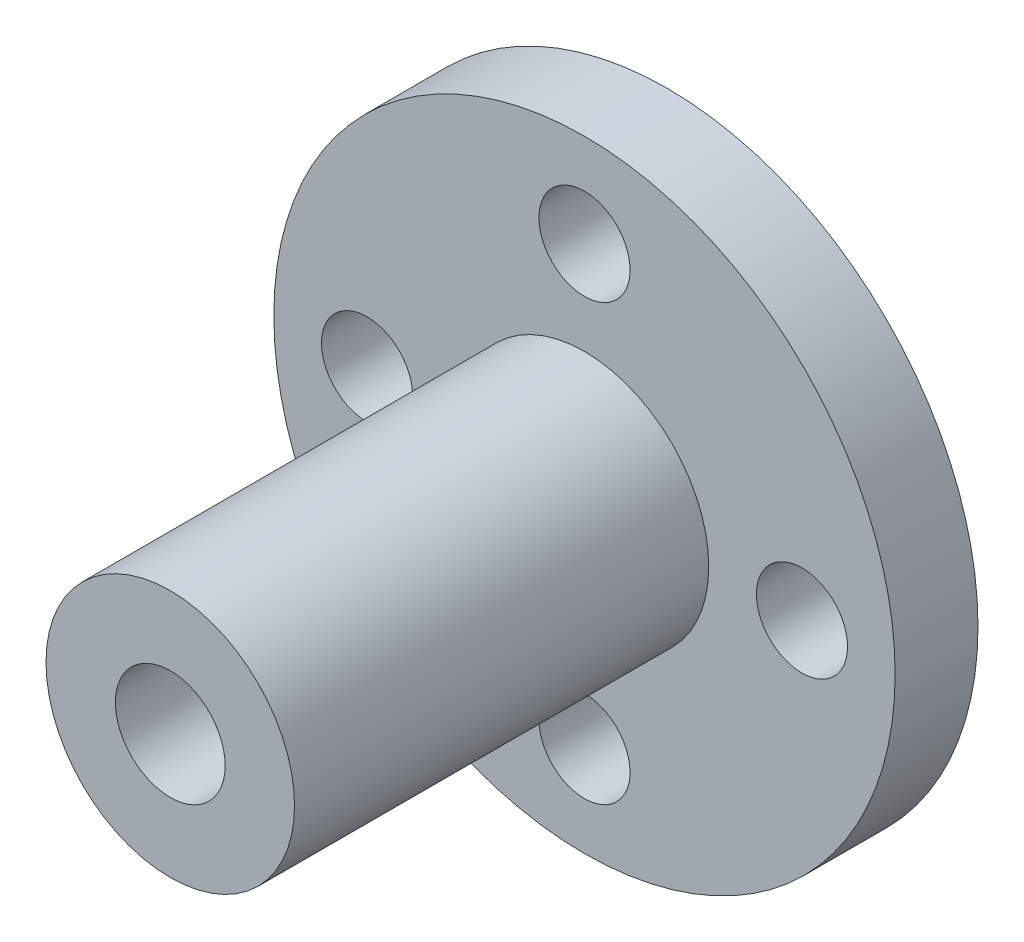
ISO-10303-21;
HEADER;
FILE_DESCRIPTION(('STEP AP214'),'2;1');
FILE_NAME('part.step','',(''),(''),'','','');
FILE_SCHEMA(('AUTOMOTIVE_DESIGN { 1 0 10303 214 1 1 1 1 }'));
ENDSEC;
DATA;
#1=APPLICATION_CONTEXT('core data for automotive mechanical design processes');
#2=APPLICATION_PROTOCOL_DEFINITION('international standard','automotive_design',2000,#1);
#3=PRODUCT_CONTEXT('',#1,'mechanical');
#4=PRODUCT('Part','Part','',(#3));
#5=PRODUCT_RELATED_PRODUCT_CATEGORY('part','',(#4));
#6=PRODUCT_DEFINITION_FORMATION('','',#4);
#7=PRODUCT_DEFINITION_CONTEXT('part definition',#1,'design');
#8=PRODUCT_DEFINITION('design','',#6,#7);
#9=PRODUCT_DEFINITION_SHAPE('','',#8);
#10=(LENGTH_UNIT() NAMED_UNIT(*) SI_UNIT(.MILLI.,.METRE.));
#11=(NAMED_UNIT(*) PLANE_ANGLE_UNIT() SI_UNIT($,.RADIAN.));
#12=(NAMED_UNIT(*) SI_UNIT($,.STERADIAN.) SOLID_ANGLE_UNIT());
#13=UNCERTAINTY_MEASURE_WITH_UNIT(LENGTH_MEASURE(1.E-05),#10,'distance_accuracy_value','');
#14=(GEOMETRIC_REPRESENTATION_CONTEXT(3) GLOBAL_UNCERTAINTY_ASSIGNED_CONTEXT((#13)) GLOBAL_UNIT_ASSIGNED_CONTEXT((#10,
#11,#12)) REPRESENTATION_CONTEXT('',''));
#15=CARTESIAN_POINT('',(0.,0.,0.));
#16=DIRECTION('',(0.,0.,1.));
#17=DIRECTION('',(1.,0.,0.));
#18=AXIS2_PLACEMENT_3D('',#15,#16,#17);
#19=CARTESIAN_POINT('',(0.,0.,0.));
#20=DIRECTION('',(0.,0.,1.));
#21=DIRECTION('',(1.,0.,0.));
#22=AXIS2_PLACEMENT_3D('',#19,#20,#21);
#23=PLANE('',#22);
#24=CARTESIAN_POINT('',(0.,0.,0.));
#25=DIRECTION('',(0.,0.,1.));
#26=DIRECTION('',(1.,0.,0.));
#27=AXIS2_PLACEMENT_3D('',#24,#25,#26);
#28=CIRCLE('',#27,75.);
#29=CARTESIAN_POINT('',(75.,0.,0.));
#30=VERTEX_POINT('',#29);
#31=EDGE_CURVE('E41',#30,#30,#28,.T.);
#32=ORIENTED_EDGE('',*,*,#31,.F.);
#33=EDGE_LOOP('',(#32));
#34=FACE_BOUND('',#33,.T.);
#35=CARTESIAN_POINT('',(52.5,0.,0.));
#36=DIRECTION('',(0.,0.,1.));
#37=DIRECTION('',(1.,0.,0.));
#38=AXIS2_PLACEMENT_3D('',#35,#36,#37);
#39=CIRCLE('',#38,11.);
#40=CARTESIAN_POINT('',(63.5,0.,0.));
#41=VERTEX_POINT('',#40);
#42=EDGE_CURVE('E46',#41,#41,#39,.T.);
#43=ORIENTED_EDGE('',*,*,#42,.T.);
#44=EDGE_LOOP('',(#43));
#45=FACE_BOUND('',#44,.T.);
#46=CARTESIAN_POINT('',(-1.83302770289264E-13,52.5,0.));
#47=DIRECTION('',(0.,0.,1.));
#48=DIRECTION('',(0.,1.,0.));
#49=AXIS2_PLACEMENT_3D('',#46,#47,#48);
#50=CIRCLE('',#49,11.);
#51=CARTESIAN_POINT('',(-2.21709065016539E-13,63.5,0.));
#52=VERTEX_POINT('',#51);
#53=EDGE_CURVE('E51',#52,#52,#50,.T.);
#54=ORIENTED_EDGE('',*,*,#53,.T.);
#55=EDGE_LOOP('',(#54));
#56=FACE_BOUND('',#55,.T.);
#57=CARTESIAN_POINT('',(-52.5,-3.66605540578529E-13,0.));
#58=DIRECTION('',(0.,0.,1.));
#59=DIRECTION('',(-1.,0.,0.));
#60=AXIS2_PLACEMENT_3D('',#57,#58,#59);
#61=CIRCLE('',#60,11.);
#62=CARTESIAN_POINT('',(-63.5,-4.43418130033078E-13,0.));
#63=VERTEX_POINT('',#62);
#64=EDGE_CURVE('E57',#63,#63,#61,.T.);
#65=ORIENTED_EDGE('',*,*,#64,.T.);
#66=EDGE_LOOP('',(#65));
#67=FACE_BOUND('',#66,.T.);
#68=CARTESIAN_POINT('',(5.49908310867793E-13,-52.5,0.));
#69=DIRECTION('',(0.,0.,1.));
#70=DIRECTION('',(0.,-1.,0.));
#71=AXIS2_PLACEMENT_3D('',#68,#69,#70);
#72=CIRCLE('',#71,11.);
#73=CARTESIAN_POINT('',(6.65127195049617E-13,-63.5,0.));
#74=VERTEX_POINT('',#73);
#75=EDGE_CURVE('E63',#74,#74,#72,.T.);
#76=ORIENTED_EDGE('',*,*,#75,.T.);
#77=EDGE_LOOP('',(#76));
#78=FACE_BOUND('',#77,.T.);
#79=CARTESIAN_POINT('',(0.,0.,0.));
#80=DIRECTION('',(0.,0.,1.));
#81=DIRECTION('',(1.,0.,0.));
#82=AXIS2_PLACEMENT_3D('',#79,#80,#81);
#83=CIRCLE('',#82,13.25);
#84=CARTESIAN_POINT('',(13.25,0.,0.));
#85=VERTEX_POINT('',#84);
#86=EDGE_CURVE('E75',#85,#85,#83,.T.);
#87=ORIENTED_EDGE('',*,*,#86,.T.);
#88=EDGE_LOOP('',(#87));
#89=FACE_BOUND('',#88,.T.);
#90=ADVANCED_FACE('F30',(#34,#45,#56,#67,#78,#89),#23,.F.);
#91=CARTESIAN_POINT('',(0.,0.,120.));
#92=DIRECTION('',(0.,0.,-1.));
#93=DIRECTION('',(-1.,0.,0.));
#94=AXIS2_PLACEMENT_3D('',#91,#92,#93);
#95=PLANE('',#94);
#96=CARTESIAN_POINT('',(0.,0.,120.));
#97=DIRECTION('',(0.,0.,-1.));
#98=DIRECTION('',(-1.,0.,0.));
#99=AXIS2_PLACEMENT_3D('',#96,#97,#98);
#100=CIRCLE('',#99,30.);
#101=CARTESIAN_POINT('',(-30.,0.,120.));
#102=VERTEX_POINT('',#101);
#103=EDGE_CURVE('E69',#102,#102,#100,.T.);
#104=ORIENTED_EDGE('',*,*,#103,.F.);
#105=EDGE_LOOP('',(#104));
#106=FACE_BOUND('',#105,.T.);
#107=CARTESIAN_POINT('',(0.,0.,120.));
#108=DIRECTION('',(0.,0.,1.));
#109=DIRECTION('',(1.,0.,0.));
#110=AXIS2_PLACEMENT_3D('',#107,#108,#109);
#111=CIRCLE('',#110,13.25);
#112=CARTESIAN_POINT('',(13.25,0.,120.));
#113=VERTEX_POINT('',#112);
#114=EDGE_CURVE('E74',#113,#113,#111,.T.);
#115=ORIENTED_EDGE('',*,*,#114,.F.);
#116=EDGE_LOOP('',(#115));
#117=FACE_BOUND('',#116,.T.);
#118=ADVANCED_FACE('F84',(#106,#117),#95,.F.);
#119=CARTESIAN_POINT('',(0.,0.,20.));
#120=DIRECTION('',(0.,0.,-1.));
#121=DIRECTION('',(-1.,0.,0.));
#122=AXIS2_PLACEMENT_3D('',#119,#120,#121);
#123=CYLINDRICAL_SURFACE('',#122,75.);
#124=CARTESIAN_POINT('',(0.,0.,20.));
#125=DIRECTION('',(0.,0.,1.));
#126=DIRECTION('',(1.,0.,0.));
#127=AXIS2_PLACEMENT_3D('',#124,#125,#126);
#128=CIRCLE('',#127,75.);
#129=CARTESIAN_POINT('',(75.,0.,20.));
#130=VERTEX_POINT('',#129);
#131=EDGE_CURVE('E37',#130,#130,#128,.T.);
#132=ORIENTED_EDGE('',*,*,#131,.F.);
#133=EDGE_LOOP('',(#132));
#134=FACE_BOUND('',#133,.T.);
#135=ORIENTED_EDGE('',*,*,#31,.T.);
#136=EDGE_LOOP('',(#135));
#137=FACE_BOUND('',#136,.T.);
#138=ADVANCED_FACE('F32',(#134,#137),#123,.T.);
#139=CARTESIAN_POINT('',(0.,0.,20.));
#140=DIRECTION('',(0.,0.,1.));
#141=DIRECTION('',(1.,0.,0.));
#142=AXIS2_PLACEMENT_3D('',#139,#140,#141);
#143=PLANE('',#142);
#144=CARTESIAN_POINT('',(0.,0.,20.));
#145=DIRECTION('',(0.,0.,1.));
#146=DIRECTION('',(1.,0.,0.));
#147=AXIS2_PLACEMENT_3D('',#144,#145,#146);
#148=CIRCLE('',#147,30.);
#149=CARTESIAN_POINT('',(-30.,0.,20.));
#150=VERTEX_POINT('',#149);
#151=EDGE_CURVE('E10',#150,#150,#148,.T.);
#152=ORIENTED_EDGE('',*,*,#151,.F.);
#153=EDGE_LOOP('',(#152));
#154=FACE_BOUND('',#153,.T.);
#155=CARTESIAN_POINT('',(5.49908310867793E-13,-52.5,20.));
#156=DIRECTION('',(0.,0.,1.));
#157=DIRECTION('',(0.,-1.,0.));
#158=AXIS2_PLACEMENT_3D('',#155,#156,#157);
#159=CIRCLE('',#158,11.);
#160=CARTESIAN_POINT('',(6.65127195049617E-13,-63.5,20.));
#161=VERTEX_POINT('',#160);
#162=EDGE_CURVE('E66',#161,#161,#159,.T.);
#163=ORIENTED_EDGE('',*,*,#162,.F.);
#164=EDGE_LOOP('',(#163));
#165=FACE_BOUND('',#164,.T.);
#166=CARTESIAN_POINT('',(-52.5,-3.66605540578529E-13,20.));
#167=DIRECTION('',(0.,0.,1.));
#168=DIRECTION('',(-1.,0.,0.));
#169=AXIS2_PLACEMENT_3D('',#166,#167,#168);
#170=CIRCLE('',#169,11.);
#171=CARTESIAN_POINT('',(-63.5,-4.43418130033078E-13,20.));
#172=VERTEX_POINT('',#171);
#173=EDGE_CURVE('E60',#172,#172,#170,.T.);
#174=ORIENTED_EDGE('',*,*,#173,.F.);
#175=EDGE_LOOP('',(#174));
#176=FACE_BOUND('',#175,.T.);
#177=CARTESIAN_POINT('',(-1.83302770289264E-13,52.5,20.));
#178=DIRECTION('',(0.,0.,1.));
#179=DIRECTION('',(0.,1.,0.));
#180=AXIS2_PLACEMENT_3D('',#177,#178,#179);
#181=CIRCLE('',#180,11.);
#182=CARTESIAN_POINT('',(-2.21709065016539E-13,63.5,20.));
#183=VERTEX_POINT('',#182);
#184=EDGE_CURVE('E54',#183,#183,#181,.T.);
#185=ORIENTED_EDGE('',*,*,#184,.F.);
#186=EDGE_LOOP('',(#185));
#187=FACE_BOUND('',#186,.T.);
#188=CARTESIAN_POINT('',(52.5,0.,20.));
#189=DIRECTION('',(0.,0.,1.));
#190=DIRECTION('',(1.,0.,0.));
#191=AXIS2_PLACEMENT_3D('',#188,#189,#190);
#192=CIRCLE('',#191,11.);
#193=CARTESIAN_POINT('',(63.5,0.,20.));
#194=VERTEX_POINT('',#193);
#195=EDGE_CURVE('E48',#194,#194,#192,.T.);
#196=ORIENTED_EDGE('',*,*,#195,.F.);
#197=EDGE_LOOP('',(#196));
#198=FACE_BOUND('',#197,.T.);
#199=ORIENTED_EDGE('',*,*,#131,.T.);
#200=EDGE_LOOP('',(#199));
#201=FACE_BOUND('',#200,.T.);
#202=ADVANCED_FACE('F92',(#154,#165,#176,#187,#198,#201),#143,.T.);
#203=CARTESIAN_POINT('',(52.5,0.,0.));
#204=DIRECTION('',(0.,0.,1.));
#205=DIRECTION('',(1.,0.,0.));
#206=AXIS2_PLACEMENT_3D('',#203,#204,#205);
#207=CYLINDRICAL_SURFACE('',#206,11.);
#208=ORIENTED_EDGE('',*,*,#42,.F.);
#209=EDGE_LOOP('',(#208));
#210=FACE_BOUND('',#209,.T.);
#211=ORIENTED_EDGE('',*,*,#195,.T.);
#212=EDGE_LOOP('',(#211));
#213=FACE_BOUND('',#212,.T.);
#214=ADVANCED_FACE('F113',(#210,#213),#207,.F.);
#215=CARTESIAN_POINT('',(-1.83302770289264E-13,52.5,0.));
#216=DIRECTION('',(0.,0.,1.));
#217=DIRECTION('',(1.,0.,0.));
#218=AXIS2_PLACEMENT_3D('',#215,#216,#217);
#219=CYLINDRICAL_SURFACE('',#218,11.);
#220=ORIENTED_EDGE('',*,*,#53,.F.);
#221=EDGE_LOOP('',(#220));
#222=FACE_BOUND('',#221,.T.);
#223=ORIENTED_EDGE('',*,*,#184,.T.);
#224=EDGE_LOOP('',(#223));
#225=FACE_BOUND('',#224,.T.);
#226=ADVANCED_FACE('F109',(#222,#225),#219,.F.);
#227=CARTESIAN_POINT('',(-52.5,-3.66605540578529E-13,0.));
#228=DIRECTION('',(0.,0.,1.));
#229=DIRECTION('',(1.,0.,0.));
#230=AXIS2_PLACEMENT_3D('',#227,#228,#229);
#231=CYLINDRICAL_SURFACE('',#230,11.);
#232=ORIENTED_EDGE('',*,*,#64,.F.);
#233=EDGE_LOOP('',(#232));
#234=FACE_BOUND('',#233,.T.);
#235=ORIENTED_EDGE('',*,*,#173,.T.);
#236=EDGE_LOOP('',(#235));
#237=FACE_BOUND('',#236,.T.);
#238=ADVANCED_FACE('F105',(#234,#237),#231,.F.);
#239=CARTESIAN_POINT('',(5.49908310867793E-13,-52.5,0.));
#240=DIRECTION('',(0.,0.,1.));
#241=DIRECTION('',(1.,0.,0.));
#242=AXIS2_PLACEMENT_3D('',#239,#240,#241);
#243=CYLINDRICAL_SURFACE('',#242,11.);
#244=ORIENTED_EDGE('',*,*,#75,.F.);
#245=EDGE_LOOP('',(#244));
#246=FACE_BOUND('',#245,.T.);
#247=ORIENTED_EDGE('',*,*,#162,.T.);
#248=EDGE_LOOP('',(#247));
#249=FACE_BOUND('',#248,.T.);
#250=ADVANCED_FACE('F101',(#246,#249),#243,.F.);
#251=CARTESIAN_POINT('',(0.,0.,120.));
#252=DIRECTION('',(0.,0.,-1.));
#253=DIRECTION('',(-1.,0.,0.));
#254=AXIS2_PLACEMENT_3D('',#251,#252,#253);
#255=CYLINDRICAL_SURFACE('',#254,30.);
#256=CARTESIAN_POINT('',(-30.,0.,120.));
#257=CARTESIAN_POINT('',(-30.,0.,118.958333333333));
#258=CARTESIAN_POINT('',(-30.,0.,117.916666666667));
#259=CARTESIAN_POINT('',(-30.,0.,115.833333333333));
#260=CARTESIAN_POINT('',(-30.,0.,114.791666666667));
#261=CARTESIAN_POINT('',(-30.,0.,112.708333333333));
#262=CARTESIAN_POINT('',(-30.,0.,111.666666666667));
#263=CARTESIAN_POINT('',(-30.,0.,109.583333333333));
#264=CARTESIAN_POINT('',(-30.,0.,108.541666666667));
#265=CARTESIAN_POINT('',(-30.,0.,106.458333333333));
#266=CARTESIAN_POINT('',(-30.,0.,105.416666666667));
#267=CARTESIAN_POINT('',(-30.,0.,103.333333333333));
#268=CARTESIAN_POINT('',(-30.,0.,102.291666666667));
#269=CARTESIAN_POINT('',(-30.,0.,100.208333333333));
#270=CARTESIAN_POINT('',(-30.,0.,99.1666666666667));
#271=CARTESIAN_POINT('',(-30.,0.,97.0833333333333));
#272=CARTESIAN_POINT('',(-30.,0.,96.0416666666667));
#273=CARTESIAN_POINT('',(-30.,0.,93.9583333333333));
#274=CARTESIAN_POINT('',(-30.,0.,92.9166666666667));
#275=CARTESIAN_POINT('',(-30.,0.,90.8333333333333));
#276=CARTESIAN_POINT('',(-30.,0.,89.7916666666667));
#277=CARTESIAN_POINT('',(-30.,0.,87.7083333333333));
#278=CARTESIAN_POINT('',(-30.,0.,86.6666666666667));
#279=CARTESIAN_POINT('',(-30.,0.,84.5833333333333));
#280=CARTESIAN_POINT('',(-30.,0.,83.5416666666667));
#281=CARTESIAN_POINT('',(-30.,0.,81.4583333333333));
#282=CARTESIAN_POINT('',(-30.,0.,80.4166666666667));
#283=CARTESIAN_POINT('',(-30.,0.,78.3333333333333));
#284=CARTESIAN_POINT('',(-30.,0.,77.2916666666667));
#285=CARTESIAN_POINT('',(-30.,0.,75.2083333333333));
#286=CARTESIAN_POINT('',(-30.,0.,74.1666666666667));
#287=CARTESIAN_POINT('',(-30.,0.,72.0833333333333));
#288=CARTESIAN_POINT('',(-30.,0.,71.0416666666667));
#289=CARTESIAN_POINT('',(-30.,0.,68.9583333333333));
#290=CARTESIAN_POINT('',(-30.,0.,67.9166666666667));
#291=CARTESIAN_POINT('',(-30.,0.,65.8333333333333));
#292=CARTESIAN_POINT('',(-30.,0.,64.7916666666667));
#293=CARTESIAN_POINT('',(-30.,0.,62.7083333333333));
#294=CARTESIAN_POINT('',(-30.,0.,61.6666666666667));
#295=CARTESIAN_POINT('',(-30.,0.,59.5833333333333));
#296=CARTESIAN_POINT('',(-30.,0.,58.5416666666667));
#297=CARTESIAN_POINT('',(-30.,0.,56.4583333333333));
#298=CARTESIAN_POINT('',(-30.,0.,55.4166666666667));
#299=CARTESIAN_POINT('',(-30.,0.,53.3333333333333));
#300=CARTESIAN_POINT('',(-30.,0.,52.2916666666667));
#301=CARTESIAN_POINT('',(-30.,0.,50.2083333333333));
#302=CARTESIAN_POINT('',(-30.,0.,49.1666666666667));
#303=CARTESIAN_POINT('',(-30.,0.,47.0833333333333));
#304=CARTESIAN_POINT('',(-30.,0.,46.0416666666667));
#305=CARTESIAN_POINT('',(-30.,0.,43.9583333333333));
#306=CARTESIAN_POINT('',(-30.,0.,42.9166666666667));
#307=CARTESIAN_POINT('',(-30.,0.,40.8333333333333));
#308=CARTESIAN_POINT('',(-30.,0.,39.7916666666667));
#309=CARTESIAN_POINT('',(-30.,0.,37.7083333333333));
#310=CARTESIAN_POINT('',(-30.,0.,36.6666666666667));
#311=CARTESIAN_POINT('',(-30.,0.,34.5833333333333));
#312=CARTESIAN_POINT('',(-30.,0.,33.5416666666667));
#313=CARTESIAN_POINT('',(-30.,0.,31.4583333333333));
#314=CARTESIAN_POINT('',(-30.,0.,30.4166666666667));
#315=CARTESIAN_POINT('',(-30.,0.,28.3333333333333));
#316=CARTESIAN_POINT('',(-30.,0.,27.2916666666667));
#317=CARTESIAN_POINT('',(-30.,0.,25.2083333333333));
#318=CARTESIAN_POINT('',(-30.,0.,24.1666666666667));
#319=CARTESIAN_POINT('',(-30.,0.,22.0833333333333));
#320=CARTESIAN_POINT('',(-30.,0.,21.0416666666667));
#321=CARTESIAN_POINT('',(-30.,0.,20.));
#322=B_SPLINE_CURVE_WITH_KNOTS('',3,(#256,#257,#258,#259,#260,#261,#262,#263,#264,#265,#266,
#267,#268,#269,#270,#271,#272,#273,#274,#275,#276,#277,#278,#279,#280,#281,#282,#283,#284,#285,
#286,#287,#288,#289,#290,#291,#292,#293,#294,#295,#296,#297,#298,#299,#300,#301,#302,#303,#304,
#305,#306,#307,#308,#309,#310,#311,#312,#313,#314,#315,#316,#317,#318,#319,#320,#321),
.UNSPECIFIED.,.F.,.F.,(4,2,2,2,2,2,2,2,2,2,2,2,2,2,2,2,2,2,2,2,2,2,2,2,2,2,2,2,2,2,2,2,4),(0.,
3.125,6.25000000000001,9.37500000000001,12.5,15.625,18.75,21.875,25.,28.125,31.25,34.375,37.5,
40.625,43.75,46.875,50.,53.125,56.25,59.375,62.5,65.625,68.75,71.875,75.,78.125,81.25,84.375,
87.5,90.625,93.75,96.875,100.),.UNSPECIFIED.);
#323=EDGE_CURVE('BSEAM98',#102,#150,#322,.T.);
#324=ORIENTED_EDGE('',*,*,#103,.T.);
#325=ORIENTED_EDGE('',*,*,#151,.T.);
#326=ORIENTED_EDGE('',*,*,#323,.T.);
#327=ORIENTED_EDGE('',*,*,#323,.F.);
#328=EDGE_LOOP('',(#324,#326,#325,#327));
#329=FACE_BOUND('',#328,.T.);
#330=ADVANCED_FACE('F98',(#329),#255,.T.);
#331=CARTESIAN_POINT('',(0.,0.,120.));
#332=DIRECTION('',(0.,0.,-1.));
#333=DIRECTION('',(-1.,0.,0.));
#334=AXIS2_PLACEMENT_3D('',#331,#332,#333);
#335=CYLINDRICAL_SURFACE('',#334,13.25);
#336=ORIENTED_EDGE('',*,*,#114,.T.);
#337=EDGE_LOOP('',(#336));
#338=FACE_BOUND('',#337,.T.);
#339=ORIENTED_EDGE('',*,*,#86,.F.);
#340=EDGE_LOOP('',(#339));
#341=FACE_BOUND('',#340,.T.);
#342=ADVANCED_FACE('F81',(#338,#341),#335,.F.);
#343=CLOSED_SHELL('',(#90,#118,#138,#202,#214,#226,#238,#250,#330,#342));
#344=MANIFOLD_SOLID_BREP('B2',#343);
#345=ADVANCED_BREP_SHAPE_REPRESENTATION('',(#18,#344),#14);
#346=SHAPE_DEFINITION_REPRESENTATION(#9,#345);
ENDSEC;
END-ISO-10303-21;
